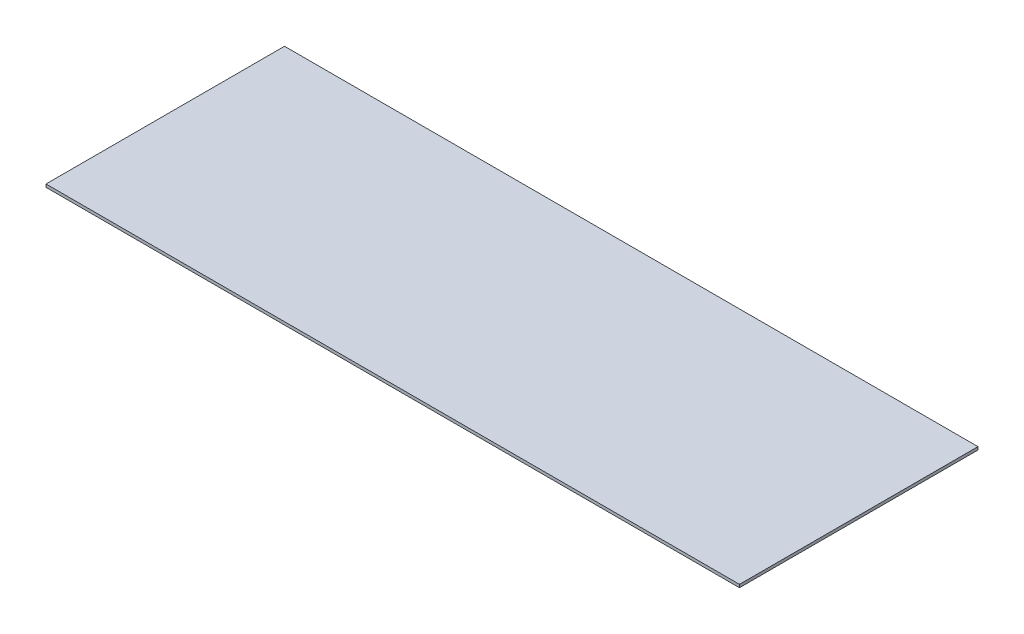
ISO-10303-21;
HEADER;
FILE_DESCRIPTION(('STEP AP214'),'2;1');
FILE_NAME('part.step','',(''),(''),'','','');
FILE_SCHEMA(('AUTOMOTIVE_DESIGN { 1 0 10303 214 1 1 1 1 }'));
ENDSEC;
DATA;
#1=APPLICATION_CONTEXT('core data for automotive mechanical design processes');
#2=APPLICATION_PROTOCOL_DEFINITION('international standard','automotive_design',2000,#1);
#3=PRODUCT_CONTEXT('',#1,'mechanical');
#4=PRODUCT('Part','Part','',(#3));
#5=PRODUCT_RELATED_PRODUCT_CATEGORY('part','',(#4));
#6=PRODUCT_DEFINITION_FORMATION('','',#4);
#7=PRODUCT_DEFINITION_CONTEXT('part definition',#1,'design');
#8=PRODUCT_DEFINITION('design','',#6,#7);
#9=PRODUCT_DEFINITION_SHAPE('','',#8);
#10=(LENGTH_UNIT() NAMED_UNIT(*) SI_UNIT(.MILLI.,.METRE.));
#11=(NAMED_UNIT(*) PLANE_ANGLE_UNIT() SI_UNIT($,.RADIAN.));
#12=(NAMED_UNIT(*) SI_UNIT($,.STERADIAN.) SOLID_ANGLE_UNIT());
#13=UNCERTAINTY_MEASURE_WITH_UNIT(LENGTH_MEASURE(1.E-05),#10,'distance_accuracy_value','');
#14=(GEOMETRIC_REPRESENTATION_CONTEXT(3) GLOBAL_UNCERTAINTY_ASSIGNED_CONTEXT((#13)) GLOBAL_UNIT_ASSIGNED_CONTEXT((#10,
#11,#12)) REPRESENTATION_CONTEXT('',''));
#15=CARTESIAN_POINT('',(0.,0.,0.));
#16=DIRECTION('',(0.,0.,1.));
#17=DIRECTION('',(1.,0.,0.));
#18=AXIS2_PLACEMENT_3D('',#15,#16,#17);
#19=CARTESIAN_POINT('',(-471.,4.,-324.));
#20=DIRECTION('',(1.,0.,0.));
#21=DIRECTION('',(0.,0.,-1.));
#22=AXIS2_PLACEMENT_3D('',#19,#20,#21);
#23=PLANE('',#22);
#24=DIRECTION('',(0.,0.,1.));
#25=VECTOR('',#24,1.);
#26=CARTESIAN_POINT('',(-471.,0.,-324.));
#27=LINE('',#26,#25);
#28=CARTESIAN_POINT('',(-471.,0.,-324.));
#29=VERTEX_POINT('',#28);
#30=CARTESIAN_POINT('',(-471.,0.,0.));
#31=VERTEX_POINT('',#30);
#32=EDGE_CURVE('E102',#29,#31,#27,.T.);
#33=ORIENTED_EDGE('',*,*,#32,.T.);
#34=DIRECTION('',(0.,-1.,0.));
#35=VECTOR('',#34,1.);
#36=CARTESIAN_POINT('',(-471.,4.,0.));
#37=LINE('',#36,#35);
#38=CARTESIAN_POINT('',(-471.,4.,0.));
#39=VERTEX_POINT('',#38);
#40=EDGE_CURVE('E11',#39,#31,#37,.T.);
#41=ORIENTED_EDGE('',*,*,#40,.F.);
#42=DIRECTION('',(0.,0.,1.));
#43=VECTOR('',#42,1.);
#44=CARTESIAN_POINT('',(-471.,4.,-324.));
#45=LINE('',#44,#43);
#46=CARTESIAN_POINT('',(-471.,4.,-324.));
#47=VERTEX_POINT('',#46);
#48=EDGE_CURVE('E87',#47,#39,#45,.T.);
#49=ORIENTED_EDGE('',*,*,#48,.F.);
#50=DIRECTION('',(0.,-1.,0.));
#51=VECTOR('',#50,1.);
#52=CARTESIAN_POINT('',(-471.,4.,-324.));
#53=LINE('',#52,#51);
#54=EDGE_CURVE('E98',#47,#29,#53,.T.);
#55=ORIENTED_EDGE('',*,*,#54,.T.);
#56=EDGE_LOOP('',(#33,#41,#49,#55));
#57=FACE_BOUND('',#56,.T.);
#58=ADVANCED_FACE('F36',(#57),#23,.F.);
#59=CARTESIAN_POINT('',(-471.,4.,0.));
#60=DIRECTION('',(0.,0.,-1.));
#61=DIRECTION('',(-1.,0.,0.));
#62=AXIS2_PLACEMENT_3D('',#59,#60,#61);
#63=PLANE('',#62);
#64=DIRECTION('',(1.,0.,0.));
#65=VECTOR('',#64,1.);
#66=CARTESIAN_POINT('',(-471.,0.,0.));
#67=LINE('',#66,#65);
#68=CARTESIAN_POINT('',(471.,0.,0.));
#69=VERTEX_POINT('',#68);
#70=EDGE_CURVE('E91',#31,#69,#67,.T.);
#71=ORIENTED_EDGE('',*,*,#70,.T.);
#72=DIRECTION('',(0.,-1.,0.));
#73=VECTOR('',#72,1.);
#74=CARTESIAN_POINT('',(471.,4.,0.));
#75=LINE('',#74,#73);
#76=CARTESIAN_POINT('',(471.,4.,0.));
#77=VERTEX_POINT('',#76);
#78=EDGE_CURVE('E44',#77,#69,#75,.T.);
#79=ORIENTED_EDGE('',*,*,#78,.F.);
#80=DIRECTION('',(1.,0.,0.));
#81=VECTOR('',#80,1.);
#82=CARTESIAN_POINT('',(-471.,4.,0.));
#83=LINE('',#82,#81);
#84=EDGE_CURVE('E82',#39,#77,#83,.T.);
#85=ORIENTED_EDGE('',*,*,#84,.F.);
#86=ORIENTED_EDGE('',*,*,#40,.T.);
#87=EDGE_LOOP('',(#71,#79,#85,#86));
#88=FACE_BOUND('',#87,.T.);
#89=ADVANCED_FACE('F90',(#88),#63,.F.);
#90=CARTESIAN_POINT('',(471.,4.,-324.));
#91=DIRECTION('',(-1.,0.,0.));
#92=DIRECTION('',(0.,0.,1.));
#93=AXIS2_PLACEMENT_3D('',#90,#91,#92);
#94=PLANE('',#93);
#95=DIRECTION('',(0.,0.,-1.));
#96=VECTOR('',#95,1.);
#97=CARTESIAN_POINT('',(471.,0.,-324.));
#98=LINE('',#97,#96);
#99=CARTESIAN_POINT('',(471.,0.,-324.));
#100=VERTEX_POINT('',#99);
#101=EDGE_CURVE('E69',#69,#100,#98,.T.);
#102=ORIENTED_EDGE('',*,*,#101,.T.);
#103=DIRECTION('',(0.,-1.,0.));
#104=VECTOR('',#103,1.);
#105=CARTESIAN_POINT('',(471.,4.,-324.));
#106=LINE('',#105,#104);
#107=CARTESIAN_POINT('',(471.,4.,-324.));
#108=VERTEX_POINT('',#107);
#109=EDGE_CURVE('E92',#108,#100,#106,.T.);
#110=ORIENTED_EDGE('',*,*,#109,.F.);
#111=DIRECTION('',(0.,0.,-1.));
#112=VECTOR('',#111,1.);
#113=CARTESIAN_POINT('',(471.,4.,-324.));
#114=LINE('',#113,#112);
#115=EDGE_CURVE('E85',#77,#108,#114,.T.);
#116=ORIENTED_EDGE('',*,*,#115,.F.);
#117=ORIENTED_EDGE('',*,*,#78,.T.);
#118=EDGE_LOOP('',(#102,#110,#116,#117));
#119=FACE_BOUND('',#118,.T.);
#120=ADVANCED_FACE('F93',(#119),#94,.F.);
#121=CARTESIAN_POINT('',(-471.,4.,-324.));
#122=DIRECTION('',(0.,0.,1.));
#123=DIRECTION('',(1.,0.,0.));
#124=AXIS2_PLACEMENT_3D('',#121,#122,#123);
#125=PLANE('',#124);
#126=DIRECTION('',(-1.,0.,0.));
#127=VECTOR('',#126,1.);
#128=CARTESIAN_POINT('',(-471.,0.,-324.));
#129=LINE('',#128,#127);
#130=EDGE_CURVE('E75',#100,#29,#129,.T.);
#131=ORIENTED_EDGE('',*,*,#130,.T.);
#132=ORIENTED_EDGE('',*,*,#54,.F.);
#133=DIRECTION('',(-1.,0.,0.));
#134=VECTOR('',#133,1.);
#135=CARTESIAN_POINT('',(-471.,4.,-324.));
#136=LINE('',#135,#134);
#137=EDGE_CURVE('E52',#108,#47,#136,.T.);
#138=ORIENTED_EDGE('',*,*,#137,.F.);
#139=ORIENTED_EDGE('',*,*,#109,.T.);
#140=EDGE_LOOP('',(#131,#132,#138,#139));
#141=FACE_BOUND('',#140,.T.);
#142=ADVANCED_FACE('F110',(#141),#125,.F.);
#143=CARTESIAN_POINT('',(0.,4.,0.));
#144=DIRECTION('',(0.,1.,0.));
#145=DIRECTION('',(0.,0.,1.));
#146=AXIS2_PLACEMENT_3D('',#143,#144,#145);
#147=PLANE('',#146);
#148=ORIENTED_EDGE('',*,*,#48,.T.);
#149=ORIENTED_EDGE('',*,*,#84,.T.);
#150=ORIENTED_EDGE('',*,*,#115,.T.);
#151=ORIENTED_EDGE('',*,*,#137,.T.);
#152=EDGE_LOOP('',(#148,#149,#150,#151));
#153=FACE_BOUND('',#152,.T.);
#154=ADVANCED_FACE('F83',(#153),#147,.T.);
#155=CARTESIAN_POINT('',(0.,0.,0.));
#156=DIRECTION('',(0.,1.,0.));
#157=DIRECTION('',(0.,0.,1.));
#158=AXIS2_PLACEMENT_3D('',#155,#156,#157);
#159=PLANE('',#158);
#160=ORIENTED_EDGE('',*,*,#32,.F.);
#161=ORIENTED_EDGE('',*,*,#130,.F.);
#162=ORIENTED_EDGE('',*,*,#101,.F.);
#163=ORIENTED_EDGE('',*,*,#70,.F.);
#164=EDGE_LOOP('',(#160,#161,#162,#163));
#165=FACE_BOUND('',#164,.T.);
#166=ADVANCED_FACE('F113',(#165),#159,.F.);
#167=CLOSED_SHELL('',(#58,#89,#120,#142,#154,#166));
#168=MANIFOLD_SOLID_BREP('B2',#167);
#169=ADVANCED_BREP_SHAPE_REPRESENTATION('',(#18,#168),#14);
#170=SHAPE_DEFINITION_REPRESENTATION(#9,#169);
ENDSEC;
END-ISO-10303-21;
